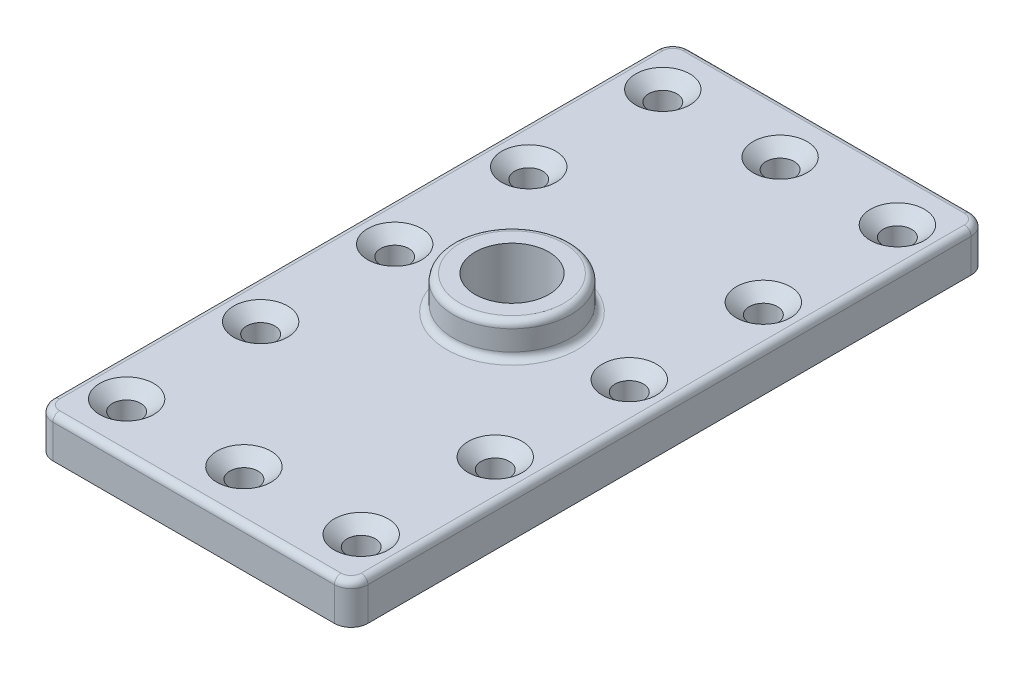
ISO-10303-21;
HEADER;
FILE_DESCRIPTION(('STEP AP214'),'2;1');
FILE_NAME('part.step','',(''),(''),'','','');
FILE_SCHEMA(('AUTOMOTIVE_DESIGN { 1 0 10303 214 1 1 1 1 }'));
ENDSEC;
DATA;
#1=APPLICATION_CONTEXT('core data for automotive mechanical design processes');
#2=APPLICATION_PROTOCOL_DEFINITION('international standard','automotive_design',2000,#1);
#3=PRODUCT_CONTEXT('',#1,'mechanical');
#4=PRODUCT('Part','Part','',(#3));
#5=PRODUCT_RELATED_PRODUCT_CATEGORY('part','',(#4));
#6=PRODUCT_DEFINITION_FORMATION('','',#4);
#7=PRODUCT_DEFINITION_CONTEXT('part definition',#1,'design');
#8=PRODUCT_DEFINITION('design','',#6,#7);
#9=PRODUCT_DEFINITION_SHAPE('','',#8);
#10=(LENGTH_UNIT() NAMED_UNIT(*) SI_UNIT(.MILLI.,.METRE.));
#11=(NAMED_UNIT(*) PLANE_ANGLE_UNIT() SI_UNIT($,.RADIAN.));
#12=(NAMED_UNIT(*) SI_UNIT($,.STERADIAN.) SOLID_ANGLE_UNIT());
#13=UNCERTAINTY_MEASURE_WITH_UNIT(LENGTH_MEASURE(1.E-05),#10,'distance_accuracy_value','');
#14=(GEOMETRIC_REPRESENTATION_CONTEXT(3) GLOBAL_UNCERTAINTY_ASSIGNED_CONTEXT((#13)) GLOBAL_UNIT_ASSIGNED_CONTEXT((#10,
#11,#12)) REPRESENTATION_CONTEXT('',''));
#15=CARTESIAN_POINT('',(0.,0.,0.));
#16=DIRECTION('',(0.,0.,1.));
#17=DIRECTION('',(1.,0.,0.));
#18=AXIS2_PLACEMENT_3D('',#15,#16,#17);
#19=CARTESIAN_POINT('',(-47.,0.,-95.));
#20=DIRECTION('',(0.,-1.,0.));
#21=DIRECTION('',(0.,0.,-1.));
#22=AXIS2_PLACEMENT_3D('',#19,#20,#21);
#23=PLANE('',#22);
#24=CARTESIAN_POINT('',(0.,0.,-80.));
#25=DIRECTION('',(0.,1.,0.));
#26=DIRECTION('',(0.,0.,1.));
#27=AXIS2_PLACEMENT_3D('',#24,#25,#26);
#28=CIRCLE('',#27,4.2164);
#29=CARTESIAN_POINT('',(0.,0.,-75.7836));
#30=VERTEX_POINT('',#29);
#31=EDGE_CURVE('E422',#30,#30,#28,.T.);
#32=ORIENTED_EDGE('',*,*,#31,.T.);
#33=EDGE_LOOP('',(#32));
#34=FACE_BOUND('',#33,.T.);
#35=CARTESIAN_POINT('',(35.,0.,-40.));
#36=DIRECTION('',(0.,1.,0.));
#37=DIRECTION('',(0.,0.,1.));
#38=AXIS2_PLACEMENT_3D('',#35,#36,#37);
#39=CIRCLE('',#38,4.21639999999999);
#40=CARTESIAN_POINT('',(35.,0.,-35.7836));
#41=VERTEX_POINT('',#40);
#42=EDGE_CURVE('E404',#41,#41,#39,.T.);
#43=ORIENTED_EDGE('',*,*,#42,.T.);
#44=EDGE_LOOP('',(#43));
#45=FACE_BOUND('',#44,.T.);
#46=CARTESIAN_POINT('',(35.,0.,0.));
#47=DIRECTION('',(0.,1.,0.));
#48=DIRECTION('',(0.,0.,1.));
#49=AXIS2_PLACEMENT_3D('',#46,#47,#48);
#50=CIRCLE('',#49,4.21639999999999);
#51=CARTESIAN_POINT('',(35.,0.,4.21639999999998));
#52=VERTEX_POINT('',#51);
#53=EDGE_CURVE('E386',#52,#52,#50,.T.);
#54=ORIENTED_EDGE('',*,*,#53,.T.);
#55=EDGE_LOOP('',(#54));
#56=FACE_BOUND('',#55,.T.);
#57=CARTESIAN_POINT('',(35.,0.,40.));
#58=DIRECTION('',(0.,1.,0.));
#59=DIRECTION('',(0.,0.,1.));
#60=AXIS2_PLACEMENT_3D('',#57,#58,#59);
#61=CIRCLE('',#60,4.21639999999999);
#62=CARTESIAN_POINT('',(35.,0.,44.2164));
#63=VERTEX_POINT('',#62);
#64=EDGE_CURVE('E368',#63,#63,#61,.T.);
#65=ORIENTED_EDGE('',*,*,#64,.T.);
#66=EDGE_LOOP('',(#65));
#67=FACE_BOUND('',#66,.T.);
#68=CARTESIAN_POINT('',(35.,0.,80.));
#69=DIRECTION('',(0.,1.,0.));
#70=DIRECTION('',(0.,0.,1.));
#71=AXIS2_PLACEMENT_3D('',#68,#69,#70);
#72=CIRCLE('',#71,4.21639999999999);
#73=CARTESIAN_POINT('',(35.,0.,84.2164));
#74=VERTEX_POINT('',#73);
#75=EDGE_CURVE('E350',#74,#74,#72,.T.);
#76=ORIENTED_EDGE('',*,*,#75,.T.);
#77=EDGE_LOOP('',(#76));
#78=FACE_BOUND('',#77,.T.);
#79=CARTESIAN_POINT('',(-35.,0.,80.));
#80=DIRECTION('',(0.,1.,0.));
#81=DIRECTION('',(0.,0.,1.));
#82=AXIS2_PLACEMENT_3D('',#79,#80,#81);
#83=CIRCLE('',#82,4.2164);
#84=CARTESIAN_POINT('',(-35.,0.,84.2164));
#85=VERTEX_POINT('',#84);
#86=EDGE_CURVE('E287',#85,#85,#83,.T.);
#87=ORIENTED_EDGE('',*,*,#86,.T.);
#88=EDGE_LOOP('',(#87));
#89=FACE_BOUND('',#88,.T.);
#90=CARTESIAN_POINT('',(0.,0.,0.));
#91=DIRECTION('',(0.,1.,0.));
#92=DIRECTION('',(0.,0.,1.));
#93=AXIS2_PLACEMENT_3D('',#90,#91,#92);
#94=CIRCLE('',#93,11.);
#95=CARTESIAN_POINT('',(0.,0.,11.));
#96=VERTEX_POINT('',#95);
#97=EDGE_CURVE('E299',#96,#96,#94,.T.);
#98=ORIENTED_EDGE('',*,*,#97,.T.);
#99=EDGE_LOOP('',(#98));
#100=FACE_BOUND('',#99,.T.);
#101=DIRECTION('',(0.,0.,-1.));
#102=VECTOR('',#101,1.);
#103=CARTESIAN_POINT('',(47.,0.,95.));
#104=LINE('',#103,#102);
#105=CARTESIAN_POINT('',(47.,0.,90.));
#106=VERTEX_POINT('',#105);
#107=CARTESIAN_POINT('',(47.,0.,-90.));
#108=VERTEX_POINT('',#107);
#109=EDGE_CURVE('E125',#106,#108,#104,.T.);
#110=ORIENTED_EDGE('',*,*,#109,.F.);
#111=CARTESIAN_POINT('',(42.,0.,90.));
#112=DIRECTION('',(0.,-1.,0.));
#113=DIRECTION('',(0.,0.,-1.));
#114=AXIS2_PLACEMENT_3D('',#111,#112,#113);
#115=CIRCLE('',#114,5.);
#116=CARTESIAN_POINT('',(42.,0.,95.));
#117=VERTEX_POINT('',#116);
#118=EDGE_CURVE('E134',#106,#117,#115,.T.);
#119=ORIENTED_EDGE('',*,*,#118,.T.);
#120=DIRECTION('',(1.,0.,0.));
#121=VECTOR('',#120,1.);
#122=CARTESIAN_POINT('',(-47.,0.,95.));
#123=LINE('',#122,#121);
#124=CARTESIAN_POINT('',(-42.,0.,95.));
#125=VERTEX_POINT('',#124);
#126=EDGE_CURVE('E148',#125,#117,#123,.T.);
#127=ORIENTED_EDGE('',*,*,#126,.F.);
#128=CARTESIAN_POINT('',(-42.,0.,90.));
#129=DIRECTION('',(0.,-1.,0.));
#130=DIRECTION('',(0.,0.,-1.));
#131=AXIS2_PLACEMENT_3D('',#128,#129,#130);
#132=CIRCLE('',#131,5.);
#133=CARTESIAN_POINT('',(-47.,0.,90.));
#134=VERTEX_POINT('',#133);
#135=EDGE_CURVE('E142',#125,#134,#132,.T.);
#136=ORIENTED_EDGE('',*,*,#135,.T.);
#137=DIRECTION('',(0.,0.,1.));
#138=VECTOR('',#137,1.);
#139=CARTESIAN_POINT('',(-47.,0.,95.));
#140=LINE('',#139,#138);
#141=CARTESIAN_POINT('',(-47.,0.,-90.));
#142=VERTEX_POINT('',#141);
#143=EDGE_CURVE('E152',#142,#134,#140,.T.);
#144=ORIENTED_EDGE('',*,*,#143,.F.);
#145=CARTESIAN_POINT('',(-42.,0.,-90.));
#146=DIRECTION('',(0.,-1.,0.));
#147=DIRECTION('',(0.,0.,-1.));
#148=AXIS2_PLACEMENT_3D('',#145,#146,#147);
#149=CIRCLE('',#148,5.);
#150=CARTESIAN_POINT('',(-42.,0.,-95.));
#151=VERTEX_POINT('',#150);
#152=EDGE_CURVE('E158',#142,#151,#149,.T.);
#153=ORIENTED_EDGE('',*,*,#152,.T.);
#154=DIRECTION('',(-1.,0.,0.));
#155=VECTOR('',#154,1.);
#156=CARTESIAN_POINT('',(-47.,0.,-95.));
#157=LINE('',#156,#155);
#158=CARTESIAN_POINT('',(42.,0.,-95.));
#159=VERTEX_POINT('',#158);
#160=EDGE_CURVE('E147',#159,#151,#157,.T.);
#161=ORIENTED_EDGE('',*,*,#160,.F.);
#162=CARTESIAN_POINT('',(42.,0.,-90.));
#163=DIRECTION('',(0.,-1.,0.));
#164=DIRECTION('',(0.,0.,-1.));
#165=AXIS2_PLACEMENT_3D('',#162,#163,#164);
#166=CIRCLE('',#165,5.);
#167=EDGE_CURVE('E130',#159,#108,#166,.T.);
#168=ORIENTED_EDGE('',*,*,#167,.T.);
#169=EDGE_LOOP('',(#110,#119,#127,#136,#144,#153,#161,#168));
#170=FACE_BOUND('',#169,.T.);
#171=CARTESIAN_POINT('',(0.,0.,80.));
#172=DIRECTION('',(0.,1.,0.));
#173=DIRECTION('',(0.,0.,1.));
#174=AXIS2_PLACEMENT_3D('',#171,#172,#173);
#175=CIRCLE('',#174,4.2164);
#176=CARTESIAN_POINT('',(0.,0.,84.2164));
#177=VERTEX_POINT('',#176);
#178=EDGE_CURVE('E341',#177,#177,#175,.T.);
#179=ORIENTED_EDGE('',*,*,#178,.T.);
#180=EDGE_LOOP('',(#179));
#181=FACE_BOUND('',#180,.T.);
#182=CARTESIAN_POINT('',(-35.,0.,40.));
#183=DIRECTION('',(0.,1.,0.));
#184=DIRECTION('',(0.,0.,1.));
#185=AXIS2_PLACEMENT_3D('',#182,#183,#184);
#186=CIRCLE('',#185,4.2164);
#187=CARTESIAN_POINT('',(-35.,0.,44.2164));
#188=VERTEX_POINT('',#187);
#189=EDGE_CURVE('E359',#188,#188,#186,.T.);
#190=ORIENTED_EDGE('',*,*,#189,.T.);
#191=EDGE_LOOP('',(#190));
#192=FACE_BOUND('',#191,.T.);
#193=CARTESIAN_POINT('',(-35.,0.,0.));
#194=DIRECTION('',(0.,1.,0.));
#195=DIRECTION('',(0.,0.,1.));
#196=AXIS2_PLACEMENT_3D('',#193,#194,#195);
#197=CIRCLE('',#196,4.2164);
#198=CARTESIAN_POINT('',(-35.,0.,4.21639999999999));
#199=VERTEX_POINT('',#198);
#200=EDGE_CURVE('E377',#199,#199,#197,.T.);
#201=ORIENTED_EDGE('',*,*,#200,.T.);
#202=EDGE_LOOP('',(#201));
#203=FACE_BOUND('',#202,.T.);
#204=CARTESIAN_POINT('',(-35.,0.,-40.));
#205=DIRECTION('',(0.,1.,0.));
#206=DIRECTION('',(0.,0.,1.));
#207=AXIS2_PLACEMENT_3D('',#204,#205,#206);
#208=CIRCLE('',#207,4.2164);
#209=CARTESIAN_POINT('',(-35.,0.,-35.7836));
#210=VERTEX_POINT('',#209);
#211=EDGE_CURVE('E395',#210,#210,#208,.T.);
#212=ORIENTED_EDGE('',*,*,#211,.T.);
#213=EDGE_LOOP('',(#212));
#214=FACE_BOUND('',#213,.T.);
#215=CARTESIAN_POINT('',(-35.,0.,-80.));
#216=DIRECTION('',(0.,1.,0.));
#217=DIRECTION('',(0.,0.,1.));
#218=AXIS2_PLACEMENT_3D('',#215,#216,#217);
#219=CIRCLE('',#218,4.2164);
#220=CARTESIAN_POINT('',(-35.,0.,-75.7836));
#221=VERTEX_POINT('',#220);
#222=EDGE_CURVE('E413',#221,#221,#219,.T.);
#223=ORIENTED_EDGE('',*,*,#222,.T.);
#224=EDGE_LOOP('',(#223));
#225=FACE_BOUND('',#224,.T.);
#226=CARTESIAN_POINT('',(35.,0.,-80.));
#227=DIRECTION('',(0.,1.,0.));
#228=DIRECTION('',(0.,0.,1.));
#229=AXIS2_PLACEMENT_3D('',#226,#227,#228);
#230=CIRCLE('',#229,4.21639999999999);
#231=CARTESIAN_POINT('',(35.,0.,-75.7836));
#232=VERTEX_POINT('',#231);
#233=EDGE_CURVE('E430',#232,#232,#230,.T.);
#234=ORIENTED_EDGE('',*,*,#233,.T.);
#235=EDGE_LOOP('',(#234));
#236=FACE_BOUND('',#235,.T.);
#237=ADVANCED_FACE('F28',(#34,#45,#56,#67,#78,#89,#100,#170,#181,#192,#203,#214,#225,#236),#23,.T.);
#238=CARTESIAN_POINT('',(-47.,12.,-95.));
#239=DIRECTION('',(0.,-1.,0.));
#240=DIRECTION('',(0.,0.,-1.));
#241=AXIS2_PLACEMENT_3D('',#238,#239,#240);
#242=PLANE('',#241);
#243=CARTESIAN_POINT('',(35.,12.,-80.));
#244=DIRECTION('',(0.,1.,0.));
#245=DIRECTION('',(0.,0.,1.));
#246=AXIS2_PLACEMENT_3D('',#243,#244,#245);
#247=CIRCLE('',#246,8.0645);
#248=CARTESIAN_POINT('',(35.,12.,-71.9355));
#249=VERTEX_POINT('',#248);
#250=EDGE_CURVE('E424',#249,#249,#247,.T.);
#251=ORIENTED_EDGE('',*,*,#250,.F.);
#252=EDGE_LOOP('',(#251));
#253=FACE_BOUND('',#252,.T.);
#254=CARTESIAN_POINT('',(0.,12.,-80.));
#255=DIRECTION('',(0.,1.,0.));
#256=DIRECTION('',(0.,0.,1.));
#257=AXIS2_PLACEMENT_3D('',#254,#255,#256);
#258=CIRCLE('',#257,8.0645);
#259=CARTESIAN_POINT('',(0.,12.,-71.9355));
#260=VERTEX_POINT('',#259);
#261=EDGE_CURVE('E416',#260,#260,#258,.T.);
#262=ORIENTED_EDGE('',*,*,#261,.F.);
#263=EDGE_LOOP('',(#262));
#264=FACE_BOUND('',#263,.T.);
#265=CARTESIAN_POINT('',(-35.,12.,-80.));
#266=DIRECTION('',(0.,1.,0.));
#267=DIRECTION('',(0.,0.,1.));
#268=AXIS2_PLACEMENT_3D('',#265,#266,#267);
#269=CIRCLE('',#268,8.0645);
#270=CARTESIAN_POINT('',(-35.,12.,-71.9355));
#271=VERTEX_POINT('',#270);
#272=EDGE_CURVE('E407',#271,#271,#269,.T.);
#273=ORIENTED_EDGE('',*,*,#272,.F.);
#274=EDGE_LOOP('',(#273));
#275=FACE_BOUND('',#274,.T.);
#276=CARTESIAN_POINT('',(35.,12.,-40.));
#277=DIRECTION('',(0.,1.,0.));
#278=DIRECTION('',(0.,0.,1.));
#279=AXIS2_PLACEMENT_3D('',#276,#277,#278);
#280=CIRCLE('',#279,8.0645);
#281=CARTESIAN_POINT('',(35.,12.,-31.9355));
#282=VERTEX_POINT('',#281);
#283=EDGE_CURVE('E398',#282,#282,#280,.T.);
#284=ORIENTED_EDGE('',*,*,#283,.F.);
#285=EDGE_LOOP('',(#284));
#286=FACE_BOUND('',#285,.T.);
#287=CARTESIAN_POINT('',(-35.,12.,-40.));
#288=DIRECTION('',(0.,1.,0.));
#289=DIRECTION('',(0.,0.,1.));
#290=AXIS2_PLACEMENT_3D('',#287,#288,#289);
#291=CIRCLE('',#290,8.0645);
#292=CARTESIAN_POINT('',(-35.,12.,-31.9355));
#293=VERTEX_POINT('',#292);
#294=EDGE_CURVE('E389',#293,#293,#291,.T.);
#295=ORIENTED_EDGE('',*,*,#294,.F.);
#296=EDGE_LOOP('',(#295));
#297=FACE_BOUND('',#296,.T.);
#298=CARTESIAN_POINT('',(35.,12.,0.));
#299=DIRECTION('',(0.,1.,0.));
#300=DIRECTION('',(0.,0.,1.));
#301=AXIS2_PLACEMENT_3D('',#298,#299,#300);
#302=CIRCLE('',#301,8.0645);
#303=CARTESIAN_POINT('',(35.,12.,8.06449999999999));
#304=VERTEX_POINT('',#303);
#305=EDGE_CURVE('E380',#304,#304,#302,.T.);
#306=ORIENTED_EDGE('',*,*,#305,.F.);
#307=EDGE_LOOP('',(#306));
#308=FACE_BOUND('',#307,.T.);
#309=CARTESIAN_POINT('',(-35.,12.,0.));
#310=DIRECTION('',(0.,1.,0.));
#311=DIRECTION('',(0.,0.,1.));
#312=AXIS2_PLACEMENT_3D('',#309,#310,#311);
#313=CIRCLE('',#312,8.0645);
#314=CARTESIAN_POINT('',(-35.,12.,8.06449999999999));
#315=VERTEX_POINT('',#314);
#316=EDGE_CURVE('E371',#315,#315,#313,.T.);
#317=ORIENTED_EDGE('',*,*,#316,.F.);
#318=EDGE_LOOP('',(#317));
#319=FACE_BOUND('',#318,.T.);
#320=CARTESIAN_POINT('',(35.,12.,40.));
#321=DIRECTION('',(0.,1.,0.));
#322=DIRECTION('',(0.,0.,1.));
#323=AXIS2_PLACEMENT_3D('',#320,#321,#322);
#324=CIRCLE('',#323,8.0645);
#325=CARTESIAN_POINT('',(35.,12.,48.0645));
#326=VERTEX_POINT('',#325);
#327=EDGE_CURVE('E362',#326,#326,#324,.T.);
#328=ORIENTED_EDGE('',*,*,#327,.F.);
#329=EDGE_LOOP('',(#328));
#330=FACE_BOUND('',#329,.T.);
#331=CARTESIAN_POINT('',(-35.,12.,40.));
#332=DIRECTION('',(0.,1.,0.));
#333=DIRECTION('',(0.,0.,1.));
#334=AXIS2_PLACEMENT_3D('',#331,#332,#333);
#335=CIRCLE('',#334,8.0645);
#336=CARTESIAN_POINT('',(-35.,12.,48.0645));
#337=VERTEX_POINT('',#336);
#338=EDGE_CURVE('E353',#337,#337,#335,.T.);
#339=ORIENTED_EDGE('',*,*,#338,.F.);
#340=EDGE_LOOP('',(#339));
#341=FACE_BOUND('',#340,.T.);
#342=CARTESIAN_POINT('',(35.,12.,80.));
#343=DIRECTION('',(0.,1.,0.));
#344=DIRECTION('',(0.,0.,1.));
#345=AXIS2_PLACEMENT_3D('',#342,#343,#344);
#346=CIRCLE('',#345,8.0645);
#347=CARTESIAN_POINT('',(35.,12.,88.0645));
#348=VERTEX_POINT('',#347);
#349=EDGE_CURVE('E344',#348,#348,#346,.T.);
#350=ORIENTED_EDGE('',*,*,#349,.F.);
#351=EDGE_LOOP('',(#350));
#352=FACE_BOUND('',#351,.T.);
#353=CARTESIAN_POINT('',(0.,12.,80.));
#354=DIRECTION('',(0.,1.,0.));
#355=DIRECTION('',(0.,0.,1.));
#356=AXIS2_PLACEMENT_3D('',#353,#354,#355);
#357=CIRCLE('',#356,8.0645);
#358=CARTESIAN_POINT('',(0.,12.,88.0645));
#359=VERTEX_POINT('',#358);
#360=EDGE_CURVE('E333',#359,#359,#357,.T.);
#361=ORIENTED_EDGE('',*,*,#360,.F.);
#362=EDGE_LOOP('',(#361));
#363=FACE_BOUND('',#362,.T.);
#364=CARTESIAN_POINT('',(42.,12.,90.));
#365=DIRECTION('',(0.,-1.,0.));
#366=DIRECTION('',(0.,0.,-1.));
#367=AXIS2_PLACEMENT_3D('',#364,#365,#366);
#368=CIRCLE('',#367,3.);
#369=CARTESIAN_POINT('',(42.,12.,93.));
#370=VERTEX_POINT('',#369);
#371=CARTESIAN_POINT('',(45.,12.,90.));
#372=VERTEX_POINT('',#371);
#373=EDGE_CURVE('E185',#370,#372,#368,.F.);
#374=ORIENTED_EDGE('',*,*,#373,.T.);
#375=DIRECTION('',(0.,0.,-1.));
#376=VECTOR('',#375,1.);
#377=CARTESIAN_POINT('',(45.,12.,-95.));
#378=LINE('',#377,#376);
#379=CARTESIAN_POINT('',(45.,12.,-90.));
#380=VERTEX_POINT('',#379);
#381=EDGE_CURVE('E189',#372,#380,#378,.T.);
#382=ORIENTED_EDGE('',*,*,#381,.T.);
#383=CARTESIAN_POINT('',(42.,12.,-90.));
#384=DIRECTION('',(0.,-1.,0.));
#385=DIRECTION('',(0.,0.,-1.));
#386=AXIS2_PLACEMENT_3D('',#383,#384,#385);
#387=CIRCLE('',#386,3.);
#388=CARTESIAN_POINT('',(42.,12.,-93.));
#389=VERTEX_POINT('',#388);
#390=EDGE_CURVE('E187',#380,#389,#387,.F.);
#391=ORIENTED_EDGE('',*,*,#390,.T.);
#392=DIRECTION('',(-1.,0.,0.));
#393=VECTOR('',#392,1.);
#394=CARTESIAN_POINT('',(-47.,12.,-93.));
#395=LINE('',#394,#393);
#396=CARTESIAN_POINT('',(-42.,12.,-93.));
#397=VERTEX_POINT('',#396);
#398=EDGE_CURVE('E183',#389,#397,#395,.T.);
#399=ORIENTED_EDGE('',*,*,#398,.T.);
#400=CARTESIAN_POINT('',(-42.,12.,-90.));
#401=DIRECTION('',(0.,-1.,0.));
#402=DIRECTION('',(0.,0.,-1.));
#403=AXIS2_PLACEMENT_3D('',#400,#401,#402);
#404=CIRCLE('',#403,3.);
#405=CARTESIAN_POINT('',(-45.,12.,-90.));
#406=VERTEX_POINT('',#405);
#407=EDGE_CURVE('E179',#397,#406,#404,.F.);
#408=ORIENTED_EDGE('',*,*,#407,.T.);
#409=DIRECTION('',(0.,0.,1.));
#410=VECTOR('',#409,1.);
#411=CARTESIAN_POINT('',(-45.,12.,-95.));
#412=LINE('',#411,#410);
#413=CARTESIAN_POINT('',(-45.,12.,90.));
#414=VERTEX_POINT('',#413);
#415=EDGE_CURVE('E175',#406,#414,#412,.T.);
#416=ORIENTED_EDGE('',*,*,#415,.T.);
#417=CARTESIAN_POINT('',(-42.,12.,90.));
#418=DIRECTION('',(0.,-1.,0.));
#419=DIRECTION('',(0.,0.,-1.));
#420=AXIS2_PLACEMENT_3D('',#417,#418,#419);
#421=CIRCLE('',#420,3.);
#422=CARTESIAN_POINT('',(-42.,12.,93.));
#423=VERTEX_POINT('',#422);
#424=EDGE_CURVE('E177',#414,#423,#421,.F.);
#425=ORIENTED_EDGE('',*,*,#424,.T.);
#426=DIRECTION('',(1.,0.,0.));
#427=VECTOR('',#426,1.);
#428=CARTESIAN_POINT('',(-47.,12.,93.));
#429=LINE('',#428,#427);
#430=EDGE_CURVE('E181',#423,#370,#429,.T.);
#431=ORIENTED_EDGE('',*,*,#430,.T.);
#432=EDGE_LOOP('',(#374,#382,#391,#399,#408,#416,#425,#431));
#433=FACE_BOUND('',#432,.T.);
#434=CARTESIAN_POINT('',(0.,12.,0.));
#435=DIRECTION('',(0.,-1.,0.));
#436=DIRECTION('',(0.,0.,-1.));
#437=AXIS2_PLACEMENT_3D('',#434,#435,#436);
#438=CIRCLE('',#437,19.5);
#439=CARTESIAN_POINT('',(0.,12.,-19.5));
#440=VERTEX_POINT('',#439);
#441=EDGE_CURVE('E172',#440,#440,#438,.T.);
#442=ORIENTED_EDGE('',*,*,#441,.T.);
#443=EDGE_LOOP('',(#442));
#444=FACE_BOUND('',#443,.T.);
#445=CARTESIAN_POINT('',(-35.,12.,80.));
#446=DIRECTION('',(0.,1.,0.));
#447=DIRECTION('',(0.,0.,1.));
#448=AXIS2_PLACEMENT_3D('',#445,#446,#447);
#449=CIRCLE('',#448,8.0645);
#450=CARTESIAN_POINT('',(-35.,12.,88.0645));
#451=VERTEX_POINT('',#450);
#452=EDGE_CURVE('E293',#451,#451,#449,.T.);
#453=ORIENTED_EDGE('',*,*,#452,.F.);
#454=EDGE_LOOP('',(#453));
#455=FACE_BOUND('',#454,.T.);
#456=ADVANCED_FACE('F231',(#253,#264,#275,#286,#297,#308,#319,#330,#341,#352,#363,#433,#444,
#455),#242,.F.);
#457=CARTESIAN_POINT('',(-47.,12.,95.));
#458=DIRECTION('',(1.,0.,0.));
#459=DIRECTION('',(0.,0.,-1.));
#460=AXIS2_PLACEMENT_3D('',#457,#458,#459);
#461=PLANE('',#460);
#462=DIRECTION('',(0.,-1.,0.));
#463=VECTOR('',#462,1.);
#464=CARTESIAN_POINT('',(-47.,12.,90.));
#465=LINE('',#464,#463);
#466=CARTESIAN_POINT('',(-47.,10.,90.));
#467=VERTEX_POINT('',#466);
#468=EDGE_CURVE('E165',#134,#467,#465,.F.);
#469=ORIENTED_EDGE('',*,*,#468,.T.);
#470=DIRECTION('',(0.,0.,1.));
#471=VECTOR('',#470,1.);
#472=CARTESIAN_POINT('',(-47.,10.,95.));
#473=LINE('',#472,#471);
#474=CARTESIAN_POINT('',(-47.,10.,-90.));
#475=VERTEX_POINT('',#474);
#476=EDGE_CURVE('E50',#467,#475,#473,.F.);
#477=ORIENTED_EDGE('',*,*,#476,.T.);
#478=DIRECTION('',(0.,-1.,0.));
#479=VECTOR('',#478,1.);
#480=CARTESIAN_POINT('',(-47.,12.,-90.));
#481=LINE('',#480,#479);
#482=EDGE_CURVE('E163',#475,#142,#481,.T.);
#483=ORIENTED_EDGE('',*,*,#482,.T.);
#484=ORIENTED_EDGE('',*,*,#143,.T.);
#485=EDGE_LOOP('',(#469,#477,#483,#484));
#486=FACE_BOUND('',#485,.T.);
#487=ADVANCED_FACE('F30',(#486),#461,.F.);
#488=CARTESIAN_POINT('',(-47.,12.,95.));
#489=DIRECTION('',(0.,0.,-1.));
#490=DIRECTION('',(-1.,0.,0.));
#491=AXIS2_PLACEMENT_3D('',#488,#489,#490);
#492=PLANE('',#491);
#493=DIRECTION('',(0.,-1.,0.));
#494=VECTOR('',#493,1.);
#495=CARTESIAN_POINT('',(42.,12.,95.));
#496=LINE('',#495,#494);
#497=CARTESIAN_POINT('',(42.,10.,95.));
#498=VERTEX_POINT('',#497);
#499=EDGE_CURVE('E137',#117,#498,#496,.F.);
#500=ORIENTED_EDGE('',*,*,#499,.T.);
#501=DIRECTION('',(1.,0.,0.));
#502=VECTOR('',#501,1.);
#503=CARTESIAN_POINT('',(-47.,10.,95.));
#504=LINE('',#503,#502);
#505=CARTESIAN_POINT('',(-42.,10.,95.));
#506=VERTEX_POINT('',#505);
#507=EDGE_CURVE('E199',#498,#506,#504,.F.);
#508=ORIENTED_EDGE('',*,*,#507,.T.);
#509=DIRECTION('',(0.,-1.,0.));
#510=VECTOR('',#509,1.);
#511=CARTESIAN_POINT('',(-42.,12.,95.));
#512=LINE('',#511,#510);
#513=EDGE_CURVE('E141',#506,#125,#512,.T.);
#514=ORIENTED_EDGE('',*,*,#513,.T.);
#515=ORIENTED_EDGE('',*,*,#126,.T.);
#516=EDGE_LOOP('',(#500,#508,#514,#515));
#517=FACE_BOUND('',#516,.T.);
#518=ADVANCED_FACE('F249',(#517),#492,.F.);
#519=CARTESIAN_POINT('',(47.,12.,95.));
#520=DIRECTION('',(-1.,0.,0.));
#521=DIRECTION('',(0.,0.,1.));
#522=AXIS2_PLACEMENT_3D('',#519,#520,#521);
#523=PLANE('',#522);
#524=DIRECTION('',(0.,-1.,0.));
#525=VECTOR('',#524,1.);
#526=CARTESIAN_POINT('',(47.,12.,-90.));
#527=LINE('',#526,#525);
#528=CARTESIAN_POINT('',(47.,10.,-90.));
#529=VERTEX_POINT('',#528);
#530=EDGE_CURVE('E131',#108,#529,#527,.F.);
#531=ORIENTED_EDGE('',*,*,#530,.T.);
#532=DIRECTION('',(0.,0.,-1.));
#533=VECTOR('',#532,1.);
#534=CARTESIAN_POINT('',(47.,10.,95.));
#535=LINE('',#534,#533);
#536=CARTESIAN_POINT('',(47.,10.,90.));
#537=VERTEX_POINT('',#536);
#538=EDGE_CURVE('E128',#529,#537,#535,.F.);
#539=ORIENTED_EDGE('',*,*,#538,.T.);
#540=DIRECTION('',(0.,-1.,0.));
#541=VECTOR('',#540,1.);
#542=CARTESIAN_POINT('',(47.,12.,90.));
#543=LINE('',#542,#541);
#544=EDGE_CURVE('E120',#537,#106,#543,.T.);
#545=ORIENTED_EDGE('',*,*,#544,.T.);
#546=ORIENTED_EDGE('',*,*,#109,.T.);
#547=EDGE_LOOP('',(#531,#539,#545,#546));
#548=FACE_BOUND('',#547,.T.);
#549=ADVANCED_FACE('F123',(#548),#523,.F.);
#550=CARTESIAN_POINT('',(-47.,12.,-95.));
#551=DIRECTION('',(0.,0.,1.));
#552=DIRECTION('',(1.,0.,0.));
#553=AXIS2_PLACEMENT_3D('',#550,#551,#552);
#554=PLANE('',#553);
#555=DIRECTION('',(0.,-1.,0.));
#556=VECTOR('',#555,1.);
#557=CARTESIAN_POINT('',(-42.,12.,-95.));
#558=LINE('',#557,#556);
#559=CARTESIAN_POINT('',(-42.,10.,-95.));
#560=VERTEX_POINT('',#559);
#561=EDGE_CURVE('E169',#151,#560,#558,.F.);
#562=ORIENTED_EDGE('',*,*,#561,.T.);
#563=DIRECTION('',(-1.,0.,0.));
#564=VECTOR('',#563,1.);
#565=CARTESIAN_POINT('',(-47.,10.,-95.));
#566=LINE('',#565,#564);
#567=CARTESIAN_POINT('',(42.,10.,-95.));
#568=VERTEX_POINT('',#567);
#569=EDGE_CURVE('E197',#560,#568,#566,.F.);
#570=ORIENTED_EDGE('',*,*,#569,.T.);
#571=DIRECTION('',(0.,-1.,0.));
#572=VECTOR('',#571,1.);
#573=CARTESIAN_POINT('',(42.,12.,-95.));
#574=LINE('',#573,#572);
#575=EDGE_CURVE('E167',#568,#159,#574,.T.);
#576=ORIENTED_EDGE('',*,*,#575,.T.);
#577=ORIENTED_EDGE('',*,*,#160,.T.);
#578=EDGE_LOOP('',(#562,#570,#576,#577));
#579=FACE_BOUND('',#578,.T.);
#580=ADVANCED_FACE('F244',(#579),#554,.F.);
#581=CARTESIAN_POINT('',(0.,22.,0.));
#582=DIRECTION('',(0.,-1.,0.));
#583=DIRECTION('',(0.,0.,-1.));
#584=AXIS2_PLACEMENT_3D('',#581,#582,#583);
#585=CYLINDRICAL_SURFACE('',#584,17.5);
#586=CARTESIAN_POINT('',(0.,14.,0.));
#587=DIRECTION('',(0.,-1.,0.));
#588=DIRECTION('',(0.,0.,-1.));
#589=AXIS2_PLACEMENT_3D('',#586,#587,#588);
#590=CIRCLE('',#589,17.5);
#591=CARTESIAN_POINT('',(0.,14.,-17.5));
#592=VERTEX_POINT('',#591);
#593=EDGE_CURVE('E36',#592,#592,#590,.F.);
#594=ORIENTED_EDGE('',*,*,#593,.T.);
#595=EDGE_LOOP('',(#594));
#596=FACE_BOUND('',#595,.T.);
#597=CARTESIAN_POINT('',(0.,20.,0.));
#598=DIRECTION('',(0.,1.,0.));
#599=DIRECTION('',(0.,0.,1.));
#600=AXIS2_PLACEMENT_3D('',#597,#598,#599);
#601=CIRCLE('',#600,17.5);
#602=CARTESIAN_POINT('',(0.,20.,17.5));
#603=VERTEX_POINT('',#602);
#604=EDGE_CURVE('E205',#603,#603,#601,.F.);
#605=ORIENTED_EDGE('',*,*,#604,.T.);
#606=EDGE_LOOP('',(#605));
#607=FACE_BOUND('',#606,.T.);
#608=ADVANCED_FACE('F210',(#596,#607),#585,.T.);
#609=CARTESIAN_POINT('',(0.,22.,0.));
#610=DIRECTION('',(0.,1.,0.));
#611=DIRECTION('',(0.,0.,1.));
#612=AXIS2_PLACEMENT_3D('',#609,#610,#611);
#613=PLANE('',#612);
#614=CARTESIAN_POINT('',(0.,22.,0.));
#615=DIRECTION('',(0.,1.,0.));
#616=DIRECTION('',(0.,0.,1.));
#617=AXIS2_PLACEMENT_3D('',#614,#615,#616);
#618=CIRCLE('',#617,15.5);
#619=CARTESIAN_POINT('',(0.,22.,15.5));
#620=VERTEX_POINT('',#619);
#621=EDGE_CURVE('E11',#620,#620,#618,.T.);
#622=ORIENTED_EDGE('',*,*,#621,.T.);
#623=EDGE_LOOP('',(#622));
#624=FACE_BOUND('',#623,.T.);
#625=CARTESIAN_POINT('',(0.,22.,0.));
#626=DIRECTION('',(0.,1.,0.));
#627=DIRECTION('',(0.,0.,1.));
#628=AXIS2_PLACEMENT_3D('',#625,#626,#627);
#629=CIRCLE('',#628,11.);
#630=CARTESIAN_POINT('',(0.,22.,11.));
#631=VERTEX_POINT('',#630);
#632=EDGE_CURVE('E296',#631,#631,#629,.T.);
#633=ORIENTED_EDGE('',*,*,#632,.F.);
#634=EDGE_LOOP('',(#633));
#635=FACE_BOUND('',#634,.T.);
#636=ADVANCED_FACE('F484',(#624,#635),#613,.T.);
#637=CARTESIAN_POINT('',(0.,0.,0.));
#638=DIRECTION('',(0.,1.,0.));
#639=DIRECTION('',(0.,0.,1.));
#640=AXIS2_PLACEMENT_3D('',#637,#638,#639);
#641=CYLINDRICAL_SURFACE('',#640,11.);
#642=ORIENTED_EDGE('',*,*,#97,.F.);
#643=EDGE_LOOP('',(#642));
#644=FACE_BOUND('',#643,.T.);
#645=ORIENTED_EDGE('',*,*,#632,.T.);
#646=EDGE_LOOP('',(#645));
#647=FACE_BOUND('',#646,.T.);
#648=ADVANCED_FACE('F475',(#644,#647),#641,.F.);
#649=CARTESIAN_POINT('',(-35.,12.,80.));
#650=DIRECTION('',(0.,1.,0.));
#651=DIRECTION('',(0.,0.,1.));
#652=AXIS2_PLACEMENT_3D('',#649,#650,#651);
#653=CONICAL_SURFACE('',#652,8.0645,0.872664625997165);
#654=CARTESIAN_POINT('',(-35.,8.77106070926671,80.));
#655=DIRECTION('',(0.,1.,0.));
#656=DIRECTION('',(0.,0.,1.));
#657=AXIS2_PLACEMENT_3D('',#654,#655,#656);
#658=CIRCLE('',#657,4.2164);
#659=CARTESIAN_POINT('',(-35.,8.77106070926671,84.2164));
#660=VERTEX_POINT('',#659);
#661=EDGE_CURVE('E290',#660,#660,#658,.T.);
#662=ORIENTED_EDGE('',*,*,#661,.F.);
#663=EDGE_LOOP('',(#662));
#664=FACE_BOUND('',#663,.T.);
#665=ORIENTED_EDGE('',*,*,#452,.T.);
#666=EDGE_LOOP('',(#665));
#667=FACE_BOUND('',#666,.T.);
#668=ADVANCED_FACE('F472',(#664,#667),#653,.F.);
#669=CARTESIAN_POINT('',(-35.,12.,80.));
#670=DIRECTION('',(0.,1.,0.));
#671=DIRECTION('',(0.,0.,1.));
#672=AXIS2_PLACEMENT_3D('',#669,#670,#671);
#673=CYLINDRICAL_SURFACE('',#672,4.2164);
#674=ORIENTED_EDGE('',*,*,#86,.F.);
#675=EDGE_LOOP('',(#674));
#676=FACE_BOUND('',#675,.T.);
#677=ORIENTED_EDGE('',*,*,#661,.T.);
#678=EDGE_LOOP('',(#677));
#679=FACE_BOUND('',#678,.T.);
#680=ADVANCED_FACE('F474',(#676,#679),#673,.F.);
#681=CARTESIAN_POINT('',(42.,12.,90.));
#682=DIRECTION('',(0.,-1.,0.));
#683=DIRECTION('',(0.,0.,-1.));
#684=AXIS2_PLACEMENT_3D('',#681,#682,#683);
#685=CYLINDRICAL_SURFACE('',#684,5.);
#686=ORIENTED_EDGE('',*,*,#544,.F.);
#687=CARTESIAN_POINT('',(42.,10.,90.));
#688=DIRECTION('',(0.,-1.,0.));
#689=DIRECTION('',(0.,0.,-1.));
#690=AXIS2_PLACEMENT_3D('',#687,#688,#689);
#691=CIRCLE('',#690,5.);
#692=EDGE_CURVE('E195',#537,#498,#691,.T.);
#693=ORIENTED_EDGE('',*,*,#692,.T.);
#694=ORIENTED_EDGE('',*,*,#499,.F.);
#695=ORIENTED_EDGE('',*,*,#118,.F.);
#696=EDGE_LOOP('',(#686,#693,#694,#695));
#697=FACE_BOUND('',#696,.T.);
#698=ADVANCED_FACE('F135',(#697),#685,.T.);
#699=CARTESIAN_POINT('',(-42.,12.,90.));
#700=DIRECTION('',(0.,-1.,0.));
#701=DIRECTION('',(0.,0.,-1.));
#702=AXIS2_PLACEMENT_3D('',#699,#700,#701);
#703=CYLINDRICAL_SURFACE('',#702,5.);
#704=ORIENTED_EDGE('',*,*,#513,.F.);
#705=CARTESIAN_POINT('',(-42.,10.,90.));
#706=DIRECTION('',(0.,-1.,0.));
#707=DIRECTION('',(0.,0.,-1.));
#708=AXIS2_PLACEMENT_3D('',#705,#706,#707);
#709=CIRCLE('',#708,5.);
#710=EDGE_CURVE('E43',#506,#467,#709,.T.);
#711=ORIENTED_EDGE('',*,*,#710,.T.);
#712=ORIENTED_EDGE('',*,*,#468,.F.);
#713=ORIENTED_EDGE('',*,*,#135,.F.);
#714=EDGE_LOOP('',(#704,#711,#712,#713));
#715=FACE_BOUND('',#714,.T.);
#716=ADVANCED_FACE('F305',(#715),#703,.T.);
#717=CARTESIAN_POINT('',(-42.,12.,-90.));
#718=DIRECTION('',(0.,-1.,0.));
#719=DIRECTION('',(0.,0.,-1.));
#720=AXIS2_PLACEMENT_3D('',#717,#718,#719);
#721=CYLINDRICAL_SURFACE('',#720,5.);
#722=ORIENTED_EDGE('',*,*,#482,.F.);
#723=CARTESIAN_POINT('',(-42.,10.,-90.));
#724=DIRECTION('',(0.,-1.,0.));
#725=DIRECTION('',(0.,0.,-1.));
#726=AXIS2_PLACEMENT_3D('',#723,#724,#725);
#727=CIRCLE('',#726,5.);
#728=EDGE_CURVE('E201',#475,#560,#727,.T.);
#729=ORIENTED_EDGE('',*,*,#728,.T.);
#730=ORIENTED_EDGE('',*,*,#561,.F.);
#731=ORIENTED_EDGE('',*,*,#152,.F.);
#732=EDGE_LOOP('',(#722,#729,#730,#731));
#733=FACE_BOUND('',#732,.T.);
#734=ADVANCED_FACE('F322',(#733),#721,.T.);
#735=CARTESIAN_POINT('',(42.,12.,-90.));
#736=DIRECTION('',(0.,-1.,0.));
#737=DIRECTION('',(0.,0.,-1.));
#738=AXIS2_PLACEMENT_3D('',#735,#736,#737);
#739=CYLINDRICAL_SURFACE('',#738,5.);
#740=ORIENTED_EDGE('',*,*,#575,.F.);
#741=CARTESIAN_POINT('',(42.,10.,-90.));
#742=DIRECTION('',(0.,-1.,0.));
#743=DIRECTION('',(0.,0.,-1.));
#744=AXIS2_PLACEMENT_3D('',#741,#742,#743);
#745=CIRCLE('',#744,5.);
#746=EDGE_CURVE('E193',#568,#529,#745,.T.);
#747=ORIENTED_EDGE('',*,*,#746,.T.);
#748=ORIENTED_EDGE('',*,*,#530,.F.);
#749=ORIENTED_EDGE('',*,*,#167,.F.);
#750=EDGE_LOOP('',(#740,#747,#748,#749));
#751=FACE_BOUND('',#750,.T.);
#752=ADVANCED_FACE('F326',(#751),#739,.T.);
#753=CARTESIAN_POINT('',(-45.,10.,-95.));
#754=DIRECTION('',(0.,0.,1.));
#755=DIRECTION('',(1.,0.,0.));
#756=AXIS2_PLACEMENT_3D('',#753,#754,#755);
#757=CYLINDRICAL_SURFACE('',#756,2.);
#758=CARTESIAN_POINT('',(-45.,10.,-90.));
#759=DIRECTION('',(0.,0.,-1.));
#760=DIRECTION('',(-1.,0.,0.));
#761=AXIS2_PLACEMENT_3D('',#758,#759,#760);
#762=CIRCLE('',#761,2.);
#763=EDGE_CURVE('E281',#475,#406,#762,.T.);
#764=ORIENTED_EDGE('',*,*,#763,.F.);
#765=ORIENTED_EDGE('',*,*,#476,.F.);
#766=CARTESIAN_POINT('',(-45.,10.,90.));
#767=DIRECTION('',(0.,0.,1.));
#768=DIRECTION('',(1.,0.,0.));
#769=AXIS2_PLACEMENT_3D('',#766,#767,#768);
#770=CIRCLE('',#769,2.);
#771=EDGE_CURVE('E284',#414,#467,#770,.T.);
#772=ORIENTED_EDGE('',*,*,#771,.F.);
#773=ORIENTED_EDGE('',*,*,#415,.F.);
#774=EDGE_LOOP('',(#764,#765,#772,#773));
#775=FACE_BOUND('',#774,.T.);
#776=ADVANCED_FACE('F313',(#775),#757,.T.);
#777=CARTESIAN_POINT('',(-42.,10.,90.));
#778=DIRECTION('',(0.,-1.,0.));
#779=DIRECTION('',(0.,0.,-1.));
#780=AXIS2_PLACEMENT_3D('',#777,#778,#779);
#781=TOROIDAL_SURFACE('',#780,3.,2.);
#782=ORIENTED_EDGE('',*,*,#771,.T.);
#783=ORIENTED_EDGE('',*,*,#710,.F.);
#784=CARTESIAN_POINT('',(-42.,10.,93.));
#785=DIRECTION('',(1.,0.,0.));
#786=DIRECTION('',(0.,0.,-1.));
#787=AXIS2_PLACEMENT_3D('',#784,#785,#786);
#788=CIRCLE('',#787,2.);
#789=EDGE_CURVE('E265',#423,#506,#788,.T.);
#790=ORIENTED_EDGE('',*,*,#789,.F.);
#791=ORIENTED_EDGE('',*,*,#424,.F.);
#792=EDGE_LOOP('',(#782,#783,#790,#791));
#793=FACE_BOUND('',#792,.T.);
#794=ADVANCED_FACE('F307',(#793),#781,.T.);
#795=CARTESIAN_POINT('',(-42.,10.,-90.));
#796=DIRECTION('',(0.,-1.,0.));
#797=DIRECTION('',(0.,0.,-1.));
#798=AXIS2_PLACEMENT_3D('',#795,#796,#797);
#799=TOROIDAL_SURFACE('',#798,3.,2.);
#800=ORIENTED_EDGE('',*,*,#763,.T.);
#801=ORIENTED_EDGE('',*,*,#407,.F.);
#802=CARTESIAN_POINT('',(-42.,10.,-93.));
#803=DIRECTION('',(1.,0.,0.));
#804=DIRECTION('',(0.,0.,-1.));
#805=AXIS2_PLACEMENT_3D('',#802,#803,#804);
#806=CIRCLE('',#805,2.);
#807=EDGE_CURVE('E270',#560,#397,#806,.T.);
#808=ORIENTED_EDGE('',*,*,#807,.F.);
#809=ORIENTED_EDGE('',*,*,#728,.F.);
#810=EDGE_LOOP('',(#800,#801,#808,#809));
#811=FACE_BOUND('',#810,.T.);
#812=ADVANCED_FACE('F318',(#811),#799,.T.);
#813=CARTESIAN_POINT('',(-47.,10.,93.));
#814=DIRECTION('',(1.,0.,0.));
#815=DIRECTION('',(0.,0.,-1.));
#816=AXIS2_PLACEMENT_3D('',#813,#814,#815);
#817=CYLINDRICAL_SURFACE('',#816,2.);
#818=ORIENTED_EDGE('',*,*,#789,.T.);
#819=ORIENTED_EDGE('',*,*,#507,.F.);
#820=CARTESIAN_POINT('',(42.,10.,93.));
#821=DIRECTION('',(1.,0.,0.));
#822=DIRECTION('',(0.,0.,-1.));
#823=AXIS2_PLACEMENT_3D('',#820,#821,#822);
#824=CIRCLE('',#823,2.);
#825=EDGE_CURVE('E262',#370,#498,#824,.T.);
#826=ORIENTED_EDGE('',*,*,#825,.F.);
#827=ORIENTED_EDGE('',*,*,#430,.F.);
#828=EDGE_LOOP('',(#818,#819,#826,#827));
#829=FACE_BOUND('',#828,.T.);
#830=ADVANCED_FACE('F260',(#829),#817,.T.);
#831=CARTESIAN_POINT('',(-47.,10.,-93.));
#832=DIRECTION('',(-1.,0.,0.));
#833=DIRECTION('',(0.,0.,1.));
#834=AXIS2_PLACEMENT_3D('',#831,#832,#833);
#835=CYLINDRICAL_SURFACE('',#834,2.);
#836=ORIENTED_EDGE('',*,*,#807,.T.);
#837=ORIENTED_EDGE('',*,*,#398,.F.);
#838=CARTESIAN_POINT('',(42.,10.,-93.));
#839=DIRECTION('',(1.,0.,0.));
#840=DIRECTION('',(0.,0.,-1.));
#841=AXIS2_PLACEMENT_3D('',#838,#839,#840);
#842=CIRCLE('',#841,2.);
#843=EDGE_CURVE('E271',#568,#389,#842,.T.);
#844=ORIENTED_EDGE('',*,*,#843,.F.);
#845=ORIENTED_EDGE('',*,*,#569,.F.);
#846=EDGE_LOOP('',(#836,#837,#844,#845));
#847=FACE_BOUND('',#846,.T.);
#848=ADVANCED_FACE('F571',(#847),#835,.T.);
#849=CARTESIAN_POINT('',(42.,10.,90.));
#850=DIRECTION('',(0.,-1.,0.));
#851=DIRECTION('',(0.,0.,-1.));
#852=AXIS2_PLACEMENT_3D('',#849,#850,#851);
#853=TOROIDAL_SURFACE('',#852,3.,2.);
#854=ORIENTED_EDGE('',*,*,#825,.T.);
#855=ORIENTED_EDGE('',*,*,#692,.F.);
#856=CARTESIAN_POINT('',(45.,10.,90.));
#857=DIRECTION('',(0.,0.,-1.));
#858=DIRECTION('',(-1.,0.,0.));
#859=AXIS2_PLACEMENT_3D('',#856,#857,#858);
#860=CIRCLE('',#859,2.);
#861=EDGE_CURVE('E276',#372,#537,#860,.T.);
#862=ORIENTED_EDGE('',*,*,#861,.F.);
#863=ORIENTED_EDGE('',*,*,#373,.F.);
#864=EDGE_LOOP('',(#854,#855,#862,#863));
#865=FACE_BOUND('',#864,.T.);
#866=ADVANCED_FACE('F268',(#865),#853,.T.);
#867=CARTESIAN_POINT('',(42.,10.,-90.));
#868=DIRECTION('',(0.,-1.,0.));
#869=DIRECTION('',(0.,0.,-1.));
#870=AXIS2_PLACEMENT_3D('',#867,#868,#869);
#871=TOROIDAL_SURFACE('',#870,3.,2.);
#872=ORIENTED_EDGE('',*,*,#843,.T.);
#873=ORIENTED_EDGE('',*,*,#390,.F.);
#874=CARTESIAN_POINT('',(45.,10.,-90.));
#875=DIRECTION('',(0.,0.,1.));
#876=DIRECTION('',(1.,0.,0.));
#877=AXIS2_PLACEMENT_3D('',#874,#875,#876);
#878=CIRCLE('',#877,2.);
#879=EDGE_CURVE('E330',#529,#380,#878,.T.);
#880=ORIENTED_EDGE('',*,*,#879,.F.);
#881=ORIENTED_EDGE('',*,*,#746,.F.);
#882=EDGE_LOOP('',(#872,#873,#880,#881));
#883=FACE_BOUND('',#882,.T.);
#884=ADVANCED_FACE('F226',(#883),#871,.T.);
#885=CARTESIAN_POINT('',(45.,10.,-95.));
#886=DIRECTION('',(0.,0.,-1.));
#887=DIRECTION('',(-1.,0.,0.));
#888=AXIS2_PLACEMENT_3D('',#885,#886,#887);
#889=CYLINDRICAL_SURFACE('',#888,2.);
#890=ORIENTED_EDGE('',*,*,#861,.T.);
#891=ORIENTED_EDGE('',*,*,#538,.F.);
#892=ORIENTED_EDGE('',*,*,#879,.T.);
#893=ORIENTED_EDGE('',*,*,#381,.F.);
#894=EDGE_LOOP('',(#890,#891,#892,#893));
#895=FACE_BOUND('',#894,.T.);
#896=ADVANCED_FACE('F216',(#895),#889,.T.);
#897=CARTESIAN_POINT('',(0.,14.,0.));
#898=DIRECTION('',(0.,-1.,0.));
#899=DIRECTION('',(0.,0.,-1.));
#900=AXIS2_PLACEMENT_3D('',#897,#898,#899);
#901=TOROIDAL_SURFACE('',#900,19.5,2.);
#902=ORIENTED_EDGE('',*,*,#441,.F.);
#903=EDGE_LOOP('',(#902));
#904=FACE_BOUND('',#903,.T.);
#905=ORIENTED_EDGE('',*,*,#593,.F.);
#906=EDGE_LOOP('',(#905));
#907=FACE_BOUND('',#906,.T.);
#908=ADVANCED_FACE('F213',(#904,#907),#901,.F.);
#909=CARTESIAN_POINT('',(0.,20.,0.));
#910=DIRECTION('',(0.,1.,0.));
#911=DIRECTION('',(0.,0.,1.));
#912=AXIS2_PLACEMENT_3D('',#909,#910,#911);
#913=TOROIDAL_SURFACE('',#912,15.5,2.);
#914=ORIENTED_EDGE('',*,*,#604,.F.);
#915=EDGE_LOOP('',(#914));
#916=FACE_BOUND('',#915,.T.);
#917=ORIENTED_EDGE('',*,*,#621,.F.);
#918=EDGE_LOOP('',(#917));
#919=FACE_BOUND('',#918,.T.);
#920=ADVANCED_FACE('F215',(#916,#919),#913,.T.);
#921=CARTESIAN_POINT('',(0.,12.,80.));
#922=DIRECTION('',(0.,1.,0.));
#923=DIRECTION('',(0.,0.,1.));
#924=AXIS2_PLACEMENT_3D('',#921,#922,#923);
#925=CONICAL_SURFACE('',#924,8.0645,0.872664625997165);
#926=CARTESIAN_POINT('',(0.,8.77106070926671,80.));
#927=DIRECTION('',(0.,1.,0.));
#928=DIRECTION('',(0.,0.,1.));
#929=AXIS2_PLACEMENT_3D('',#926,#927,#928);
#930=CIRCLE('',#929,4.2164);
#931=CARTESIAN_POINT('',(0.,8.77106070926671,84.2164));
#932=VERTEX_POINT('',#931);
#933=EDGE_CURVE('E336',#932,#932,#930,.T.);
#934=ORIENTED_EDGE('',*,*,#933,.F.);
#935=EDGE_LOOP('',(#934));
#936=FACE_BOUND('',#935,.T.);
#937=ORIENTED_EDGE('',*,*,#360,.T.);
#938=EDGE_LOOP('',(#937));
#939=FACE_BOUND('',#938,.T.);
#940=ADVANCED_FACE('F223',(#936,#939),#925,.F.);
#941=CARTESIAN_POINT('',(0.,12.,80.));
#942=DIRECTION('',(0.,1.,0.));
#943=DIRECTION('',(0.,0.,1.));
#944=AXIS2_PLACEMENT_3D('',#941,#942,#943);
#945=CYLINDRICAL_SURFACE('',#944,4.2164);
#946=ORIENTED_EDGE('',*,*,#178,.F.);
#947=EDGE_LOOP('',(#946));
#948=FACE_BOUND('',#947,.T.);
#949=ORIENTED_EDGE('',*,*,#933,.T.);
#950=EDGE_LOOP('',(#949));
#951=FACE_BOUND('',#950,.T.);
#952=ADVANCED_FACE('F609',(#948,#951),#945,.F.);
#953=CARTESIAN_POINT('',(35.,12.,80.));
#954=DIRECTION('',(0.,1.,0.));
#955=DIRECTION('',(0.,0.,1.));
#956=AXIS2_PLACEMENT_3D('',#953,#954,#955);
#957=CONICAL_SURFACE('',#956,8.0645,0.872664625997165);
#958=CARTESIAN_POINT('',(35.,8.77106070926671,80.));
#959=DIRECTION('',(0.,1.,0.));
#960=DIRECTION('',(0.,0.,1.));
#961=AXIS2_PLACEMENT_3D('',#958,#959,#960);
#962=CIRCLE('',#961,4.21639999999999);
#963=CARTESIAN_POINT('',(35.,8.77106070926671,84.2164));
#964=VERTEX_POINT('',#963);
#965=EDGE_CURVE('E347',#964,#964,#962,.T.);
#966=ORIENTED_EDGE('',*,*,#965,.F.);
#967=EDGE_LOOP('',(#966));
#968=FACE_BOUND('',#967,.T.);
#969=ORIENTED_EDGE('',*,*,#349,.T.);
#970=EDGE_LOOP('',(#969));
#971=FACE_BOUND('',#970,.T.);
#972=ADVANCED_FACE('F617',(#968,#971),#957,.F.);
#973=CARTESIAN_POINT('',(35.,12.,80.));
#974=DIRECTION('',(0.,1.,0.));
#975=DIRECTION('',(0.,0.,1.));
#976=AXIS2_PLACEMENT_3D('',#973,#974,#975);
#977=CYLINDRICAL_SURFACE('',#976,4.21639999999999);
#978=ORIENTED_EDGE('',*,*,#75,.F.);
#979=EDGE_LOOP('',(#978));
#980=FACE_BOUND('',#979,.T.);
#981=ORIENTED_EDGE('',*,*,#965,.T.);
#982=EDGE_LOOP('',(#981));
#983=FACE_BOUND('',#982,.T.);
#984=ADVANCED_FACE('F625',(#980,#983),#977,.F.);
#985=CARTESIAN_POINT('',(-35.,12.,40.));
#986=DIRECTION('',(0.,1.,0.));
#987=DIRECTION('',(0.,0.,1.));
#988=AXIS2_PLACEMENT_3D('',#985,#986,#987);
#989=CONICAL_SURFACE('',#988,8.0645,0.872664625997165);
#990=CARTESIAN_POINT('',(-35.,8.77106070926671,40.));
#991=DIRECTION('',(0.,1.,0.));
#992=DIRECTION('',(0.,0.,1.));
#993=AXIS2_PLACEMENT_3D('',#990,#991,#992);
#994=CIRCLE('',#993,4.2164);
#995=CARTESIAN_POINT('',(-35.,8.77106070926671,44.2164));
#996=VERTEX_POINT('',#995);
#997=EDGE_CURVE('E356',#996,#996,#994,.T.);
#998=ORIENTED_EDGE('',*,*,#997,.F.);
#999=EDGE_LOOP('',(#998));
#1000=FACE_BOUND('',#999,.T.);
#1001=ORIENTED_EDGE('',*,*,#338,.T.);
#1002=EDGE_LOOP('',(#1001));
#1003=FACE_BOUND('',#1002,.T.);
#1004=ADVANCED_FACE('F633',(#1000,#1003),#989,.F.);
#1005=CARTESIAN_POINT('',(-35.,12.,40.));
#1006=DIRECTION('',(0.,1.,0.));
#1007=DIRECTION('',(0.,0.,1.));
#1008=AXIS2_PLACEMENT_3D('',#1005,#1006,#1007);
#1009=CYLINDRICAL_SURFACE('',#1008,4.2164);
#1010=ORIENTED_EDGE('',*,*,#189,.F.);
#1011=EDGE_LOOP('',(#1010));
#1012=FACE_BOUND('',#1011,.T.);
#1013=ORIENTED_EDGE('',*,*,#997,.T.);
#1014=EDGE_LOOP('',(#1013));
#1015=FACE_BOUND('',#1014,.T.);
#1016=ADVANCED_FACE('F641',(#1012,#1015),#1009,.F.);
#1017=CARTESIAN_POINT('',(35.,12.,40.));
#1018=DIRECTION('',(0.,1.,0.));
#1019=DIRECTION('',(0.,0.,1.));
#1020=AXIS2_PLACEMENT_3D('',#1017,#1018,#1019);
#1021=CONICAL_SURFACE('',#1020,8.0645,0.872664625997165);
#1022=CARTESIAN_POINT('',(35.,8.77106070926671,40.));
#1023=DIRECTION('',(0.,1.,0.));
#1024=DIRECTION('',(0.,0.,1.));
#1025=AXIS2_PLACEMENT_3D('',#1022,#1023,#1024);
#1026=CIRCLE('',#1025,4.21639999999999);
#1027=CARTESIAN_POINT('',(35.,8.77106070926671,44.2164));
#1028=VERTEX_POINT('',#1027);
#1029=EDGE_CURVE('E365',#1028,#1028,#1026,.T.);
#1030=ORIENTED_EDGE('',*,*,#1029,.F.);
#1031=EDGE_LOOP('',(#1030));
#1032=FACE_BOUND('',#1031,.T.);
#1033=ORIENTED_EDGE('',*,*,#327,.T.);
#1034=EDGE_LOOP('',(#1033));
#1035=FACE_BOUND('',#1034,.T.);
#1036=ADVANCED_FACE('F649',(#1032,#1035),#1021,.F.);
#1037=CARTESIAN_POINT('',(35.,12.,40.));
#1038=DIRECTION('',(0.,1.,0.));
#1039=DIRECTION('',(0.,0.,1.));
#1040=AXIS2_PLACEMENT_3D('',#1037,#1038,#1039);
#1041=CYLINDRICAL_SURFACE('',#1040,4.21639999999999);
#1042=ORIENTED_EDGE('',*,*,#64,.F.);
#1043=EDGE_LOOP('',(#1042));
#1044=FACE_BOUND('',#1043,.T.);
#1045=ORIENTED_EDGE('',*,*,#1029,.T.);
#1046=EDGE_LOOP('',(#1045));
#1047=FACE_BOUND('',#1046,.T.);
#1048=ADVANCED_FACE('F657',(#1044,#1047),#1041,.F.);
#1049=CARTESIAN_POINT('',(-35.,12.,0.));
#1050=DIRECTION('',(0.,1.,0.));
#1051=DIRECTION('',(0.,0.,1.));
#1052=AXIS2_PLACEMENT_3D('',#1049,#1050,#1051);
#1053=CONICAL_SURFACE('',#1052,8.0645,0.872664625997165);
#1054=CARTESIAN_POINT('',(-35.,8.77106070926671,0.));
#1055=DIRECTION('',(0.,1.,0.));
#1056=DIRECTION('',(0.,0.,1.));
#1057=AXIS2_PLACEMENT_3D('',#1054,#1055,#1056);
#1058=CIRCLE('',#1057,4.2164);
#1059=CARTESIAN_POINT('',(-35.,8.77106070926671,4.21639999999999));
#1060=VERTEX_POINT('',#1059);
#1061=EDGE_CURVE('E374',#1060,#1060,#1058,.T.);
#1062=ORIENTED_EDGE('',*,*,#1061,.F.);
#1063=EDGE_LOOP('',(#1062));
#1064=FACE_BOUND('',#1063,.T.);
#1065=ORIENTED_EDGE('',*,*,#316,.T.);
#1066=EDGE_LOOP('',(#1065));
#1067=FACE_BOUND('',#1066,.T.);
#1068=ADVANCED_FACE('F665',(#1064,#1067),#1053,.F.);
#1069=CARTESIAN_POINT('',(-35.,12.,0.));
#1070=DIRECTION('',(0.,1.,0.));
#1071=DIRECTION('',(0.,0.,1.));
#1072=AXIS2_PLACEMENT_3D('',#1069,#1070,#1071);
#1073=CYLINDRICAL_SURFACE('',#1072,4.2164);
#1074=ORIENTED_EDGE('',*,*,#200,.F.);
#1075=EDGE_LOOP('',(#1074));
#1076=FACE_BOUND('',#1075,.T.);
#1077=ORIENTED_EDGE('',*,*,#1061,.T.);
#1078=EDGE_LOOP('',(#1077));
#1079=FACE_BOUND('',#1078,.T.);
#1080=ADVANCED_FACE('F673',(#1076,#1079),#1073,.F.);
#1081=CARTESIAN_POINT('',(35.,12.,0.));
#1082=DIRECTION('',(0.,1.,0.));
#1083=DIRECTION('',(0.,0.,1.));
#1084=AXIS2_PLACEMENT_3D('',#1081,#1082,#1083);
#1085=CONICAL_SURFACE('',#1084,8.0645,0.872664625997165);
#1086=CARTESIAN_POINT('',(35.,8.77106070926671,0.));
#1087=DIRECTION('',(0.,1.,0.));
#1088=DIRECTION('',(0.,0.,1.));
#1089=AXIS2_PLACEMENT_3D('',#1086,#1087,#1088);
#1090=CIRCLE('',#1089,4.21639999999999);
#1091=CARTESIAN_POINT('',(35.,8.77106070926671,4.21639999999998));
#1092=VERTEX_POINT('',#1091);
#1093=EDGE_CURVE('E383',#1092,#1092,#1090,.T.);
#1094=ORIENTED_EDGE('',*,*,#1093,.F.);
#1095=EDGE_LOOP('',(#1094));
#1096=FACE_BOUND('',#1095,.T.);
#1097=ORIENTED_EDGE('',*,*,#305,.T.);
#1098=EDGE_LOOP('',(#1097));
#1099=FACE_BOUND('',#1098,.T.);
#1100=ADVANCED_FACE('F681',(#1096,#1099),#1085,.F.);
#1101=CARTESIAN_POINT('',(35.,12.,0.));
#1102=DIRECTION('',(0.,1.,0.));
#1103=DIRECTION('',(0.,0.,1.));
#1104=AXIS2_PLACEMENT_3D('',#1101,#1102,#1103);
#1105=CYLINDRICAL_SURFACE('',#1104,4.21639999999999);
#1106=ORIENTED_EDGE('',*,*,#53,.F.);
#1107=EDGE_LOOP('',(#1106));
#1108=FACE_BOUND('',#1107,.T.);
#1109=ORIENTED_EDGE('',*,*,#1093,.T.);
#1110=EDGE_LOOP('',(#1109));
#1111=FACE_BOUND('',#1110,.T.);
#1112=ADVANCED_FACE('F689',(#1108,#1111),#1105,.F.);
#1113=CARTESIAN_POINT('',(-35.,12.,-40.));
#1114=DIRECTION('',(0.,1.,0.));
#1115=DIRECTION('',(0.,0.,1.));
#1116=AXIS2_PLACEMENT_3D('',#1113,#1114,#1115);
#1117=CONICAL_SURFACE('',#1116,8.0645,0.872664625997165);
#1118=CARTESIAN_POINT('',(-35.,8.77106070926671,-40.));
#1119=DIRECTION('',(0.,1.,0.));
#1120=DIRECTION('',(0.,0.,1.));
#1121=AXIS2_PLACEMENT_3D('',#1118,#1119,#1120);
#1122=CIRCLE('',#1121,4.2164);
#1123=CARTESIAN_POINT('',(-35.,8.77106070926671,-35.7836));
#1124=VERTEX_POINT('',#1123);
#1125=EDGE_CURVE('E392',#1124,#1124,#1122,.T.);
#1126=ORIENTED_EDGE('',*,*,#1125,.F.);
#1127=EDGE_LOOP('',(#1126));
#1128=FACE_BOUND('',#1127,.T.);
#1129=ORIENTED_EDGE('',*,*,#294,.T.);
#1130=EDGE_LOOP('',(#1129));
#1131=FACE_BOUND('',#1130,.T.);
#1132=ADVANCED_FACE('F697',(#1128,#1131),#1117,.F.);
#1133=CARTESIAN_POINT('',(-35.,12.,-40.));
#1134=DIRECTION('',(0.,1.,0.));
#1135=DIRECTION('',(0.,0.,1.));
#1136=AXIS2_PLACEMENT_3D('',#1133,#1134,#1135);
#1137=CYLINDRICAL_SURFACE('',#1136,4.2164);
#1138=ORIENTED_EDGE('',*,*,#211,.F.);
#1139=EDGE_LOOP('',(#1138));
#1140=FACE_BOUND('',#1139,.T.);
#1141=ORIENTED_EDGE('',*,*,#1125,.T.);
#1142=EDGE_LOOP('',(#1141));
#1143=FACE_BOUND('',#1142,.T.);
#1144=ADVANCED_FACE('F705',(#1140,#1143),#1137,.F.);
#1145=CARTESIAN_POINT('',(35.,12.,-40.));
#1146=DIRECTION('',(0.,1.,0.));
#1147=DIRECTION('',(0.,0.,1.));
#1148=AXIS2_PLACEMENT_3D('',#1145,#1146,#1147);
#1149=CONICAL_SURFACE('',#1148,8.0645,0.872664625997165);
#1150=CARTESIAN_POINT('',(35.,8.77106070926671,-40.));
#1151=DIRECTION('',(0.,1.,0.));
#1152=DIRECTION('',(0.,0.,1.));
#1153=AXIS2_PLACEMENT_3D('',#1150,#1151,#1152);
#1154=CIRCLE('',#1153,4.21639999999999);
#1155=CARTESIAN_POINT('',(35.,8.77106070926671,-35.7836));
#1156=VERTEX_POINT('',#1155);
#1157=EDGE_CURVE('E401',#1156,#1156,#1154,.T.);
#1158=ORIENTED_EDGE('',*,*,#1157,.F.);
#1159=EDGE_LOOP('',(#1158));
#1160=FACE_BOUND('',#1159,.T.);
#1161=ORIENTED_EDGE('',*,*,#283,.T.);
#1162=EDGE_LOOP('',(#1161));
#1163=FACE_BOUND('',#1162,.T.);
#1164=ADVANCED_FACE('F713',(#1160,#1163),#1149,.F.);
#1165=CARTESIAN_POINT('',(35.,12.,-40.));
#1166=DIRECTION('',(0.,1.,0.));
#1167=DIRECTION('',(0.,0.,1.));
#1168=AXIS2_PLACEMENT_3D('',#1165,#1166,#1167);
#1169=CYLINDRICAL_SURFACE('',#1168,4.21639999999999);
#1170=ORIENTED_EDGE('',*,*,#42,.F.);
#1171=EDGE_LOOP('',(#1170));
#1172=FACE_BOUND('',#1171,.T.);
#1173=ORIENTED_EDGE('',*,*,#1157,.T.);
#1174=EDGE_LOOP('',(#1173));
#1175=FACE_BOUND('',#1174,.T.);
#1176=ADVANCED_FACE('F721',(#1172,#1175),#1169,.F.);
#1177=CARTESIAN_POINT('',(-35.,12.,-80.));
#1178=DIRECTION('',(0.,1.,0.));
#1179=DIRECTION('',(0.,0.,1.));
#1180=AXIS2_PLACEMENT_3D('',#1177,#1178,#1179);
#1181=CONICAL_SURFACE('',#1180,8.0645,0.872664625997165);
#1182=CARTESIAN_POINT('',(-35.,8.77106070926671,-80.));
#1183=DIRECTION('',(0.,1.,0.));
#1184=DIRECTION('',(0.,0.,1.));
#1185=AXIS2_PLACEMENT_3D('',#1182,#1183,#1184);
#1186=CIRCLE('',#1185,4.2164);
#1187=CARTESIAN_POINT('',(-35.,8.77106070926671,-75.7836));
#1188=VERTEX_POINT('',#1187);
#1189=EDGE_CURVE('E410',#1188,#1188,#1186,.T.);
#1190=ORIENTED_EDGE('',*,*,#1189,.F.);
#1191=EDGE_LOOP('',(#1190));
#1192=FACE_BOUND('',#1191,.T.);
#1193=ORIENTED_EDGE('',*,*,#272,.T.);
#1194=EDGE_LOOP('',(#1193));
#1195=FACE_BOUND('',#1194,.T.);
#1196=ADVANCED_FACE('F729',(#1192,#1195),#1181,.F.);
#1197=CARTESIAN_POINT('',(-35.,12.,-80.));
#1198=DIRECTION('',(0.,1.,0.));
#1199=DIRECTION('',(0.,0.,1.));
#1200=AXIS2_PLACEMENT_3D('',#1197,#1198,#1199);
#1201=CYLINDRICAL_SURFACE('',#1200,4.2164);
#1202=ORIENTED_EDGE('',*,*,#222,.F.);
#1203=EDGE_LOOP('',(#1202));
#1204=FACE_BOUND('',#1203,.T.);
#1205=ORIENTED_EDGE('',*,*,#1189,.T.);
#1206=EDGE_LOOP('',(#1205));
#1207=FACE_BOUND('',#1206,.T.);
#1208=ADVANCED_FACE('F737',(#1204,#1207),#1201,.F.);
#1209=CARTESIAN_POINT('',(0.,12.,-80.));
#1210=DIRECTION('',(0.,1.,0.));
#1211=DIRECTION('',(0.,0.,1.));
#1212=AXIS2_PLACEMENT_3D('',#1209,#1210,#1211);
#1213=CONICAL_SURFACE('',#1212,8.0645,0.872664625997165);
#1214=CARTESIAN_POINT('',(0.,8.77106070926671,-80.));
#1215=DIRECTION('',(0.,1.,0.));
#1216=DIRECTION('',(0.,0.,1.));
#1217=AXIS2_PLACEMENT_3D('',#1214,#1215,#1216);
#1218=CIRCLE('',#1217,4.2164);
#1219=CARTESIAN_POINT('',(0.,8.77106070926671,-75.7836));
#1220=VERTEX_POINT('',#1219);
#1221=EDGE_CURVE('E419',#1220,#1220,#1218,.T.);
#1222=ORIENTED_EDGE('',*,*,#1221,.F.);
#1223=EDGE_LOOP('',(#1222));
#1224=FACE_BOUND('',#1223,.T.);
#1225=ORIENTED_EDGE('',*,*,#261,.T.);
#1226=EDGE_LOOP('',(#1225));
#1227=FACE_BOUND('',#1226,.T.);
#1228=ADVANCED_FACE('F745',(#1224,#1227),#1213,.F.);
#1229=CARTESIAN_POINT('',(0.,12.,-80.));
#1230=DIRECTION('',(0.,1.,0.));
#1231=DIRECTION('',(0.,0.,1.));
#1232=AXIS2_PLACEMENT_3D('',#1229,#1230,#1231);
#1233=CYLINDRICAL_SURFACE('',#1232,4.2164);
#1234=ORIENTED_EDGE('',*,*,#31,.F.);
#1235=EDGE_LOOP('',(#1234));
#1236=FACE_BOUND('',#1235,.T.);
#1237=ORIENTED_EDGE('',*,*,#1221,.T.);
#1238=EDGE_LOOP('',(#1237));
#1239=FACE_BOUND('',#1238,.T.);
#1240=ADVANCED_FACE('F444',(#1236,#1239),#1233,.F.);
#1241=CARTESIAN_POINT('',(35.,12.,-80.));
#1242=DIRECTION('',(0.,1.,0.));
#1243=DIRECTION('',(0.,0.,1.));
#1244=AXIS2_PLACEMENT_3D('',#1241,#1242,#1243);
#1245=CONICAL_SURFACE('',#1244,8.0645,0.872664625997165);
#1246=CARTESIAN_POINT('',(35.,8.77106070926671,-80.));
#1247=DIRECTION('',(0.,1.,0.));
#1248=DIRECTION('',(0.,0.,1.));
#1249=AXIS2_PLACEMENT_3D('',#1246,#1247,#1248);
#1250=CIRCLE('',#1249,4.21639999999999);
#1251=CARTESIAN_POINT('',(35.,8.77106070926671,-75.7836));
#1252=VERTEX_POINT('',#1251);
#1253=EDGE_CURVE('E427',#1252,#1252,#1250,.T.);
#1254=ORIENTED_EDGE('',*,*,#1253,.F.);
#1255=EDGE_LOOP('',(#1254));
#1256=FACE_BOUND('',#1255,.T.);
#1257=ORIENTED_EDGE('',*,*,#250,.T.);
#1258=EDGE_LOOP('',(#1257));
#1259=FACE_BOUND('',#1258,.T.);
#1260=ADVANCED_FACE('F438',(#1256,#1259),#1245,.F.);
#1261=CARTESIAN_POINT('',(35.,12.,-80.));
#1262=DIRECTION('',(0.,1.,0.));
#1263=DIRECTION('',(0.,0.,1.));
#1264=AXIS2_PLACEMENT_3D('',#1261,#1262,#1263);
#1265=CYLINDRICAL_SURFACE('',#1264,4.21639999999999);
#1266=ORIENTED_EDGE('',*,*,#233,.F.);
#1267=EDGE_LOOP('',(#1266));
#1268=FACE_BOUND('',#1267,.T.);
#1269=ORIENTED_EDGE('',*,*,#1253,.T.);
#1270=EDGE_LOOP('',(#1269));
#1271=FACE_BOUND('',#1270,.T.);
#1272=ADVANCED_FACE('F435',(#1268,#1271),#1265,.F.);
#1273=CLOSED_SHELL('',(#237,#456,#487,#518,#549,#580,#608,#636,#648,#668,#680,#698,#716,#734,
#752,#776,#794,#812,#830,#848,#866,#884,#896,#908,#920,#940,#952,#972,#984,#1004,#1016,#1036,
#1048,#1068,#1080,#1100,#1112,#1132,#1144,#1164,#1176,#1196,#1208,#1228,#1240,#1260,#1272));
#1274=MANIFOLD_SOLID_BREP('B2',#1273);
#1275=ADVANCED_BREP_SHAPE_REPRESENTATION('',(#18,#1274),#14);
#1276=SHAPE_DEFINITION_REPRESENTATION(#9,#1275);
ENDSEC;
END-ISO-10303-21;
